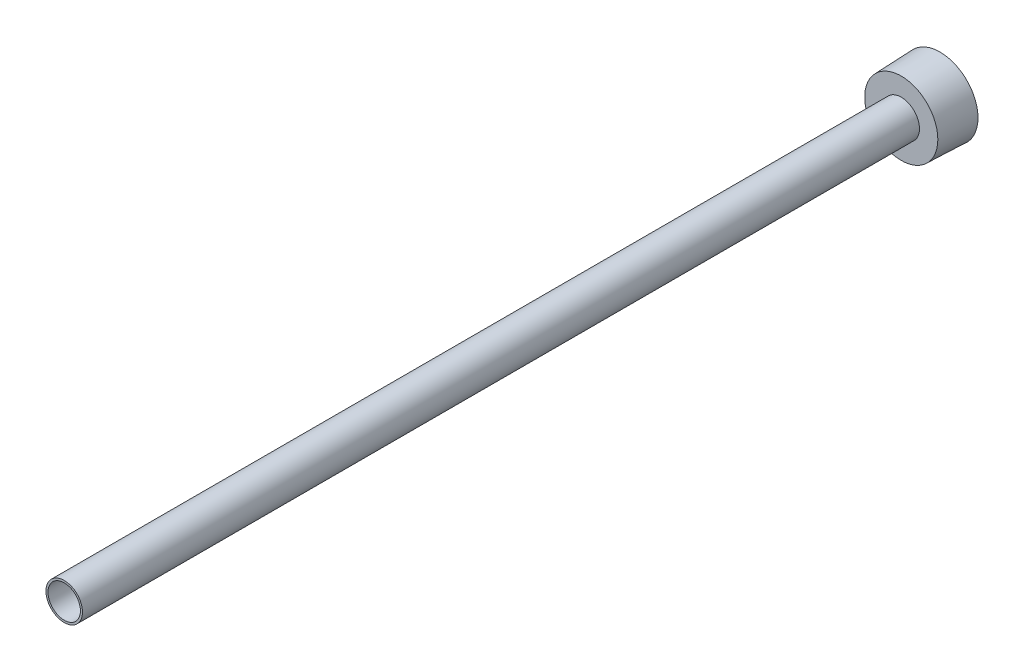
ISO-10303-21;
HEADER;
FILE_DESCRIPTION(('STEP AP214'),'2;1');
FILE_NAME('part.step','',(''),(''),'','','');
FILE_SCHEMA(('AUTOMOTIVE_DESIGN { 1 0 10303 214 1 1 1 1 }'));
ENDSEC;
DATA;
#1=APPLICATION_CONTEXT('core data for automotive mechanical design processes');
#2=APPLICATION_PROTOCOL_DEFINITION('international standard','automotive_design',2000,#1);
#3=PRODUCT_CONTEXT('',#1,'mechanical');
#4=PRODUCT('Part','Part','',(#3));
#5=PRODUCT_RELATED_PRODUCT_CATEGORY('part','',(#4));
#6=PRODUCT_DEFINITION_FORMATION('','',#4);
#7=PRODUCT_DEFINITION_CONTEXT('part definition',#1,'design');
#8=PRODUCT_DEFINITION('design','',#6,#7);
#9=PRODUCT_DEFINITION_SHAPE('','',#8);
#10=(LENGTH_UNIT() NAMED_UNIT(*) SI_UNIT(.MILLI.,.METRE.));
#11=(NAMED_UNIT(*) PLANE_ANGLE_UNIT() SI_UNIT($,.RADIAN.));
#12=(NAMED_UNIT(*) SI_UNIT($,.STERADIAN.) SOLID_ANGLE_UNIT());
#13=UNCERTAINTY_MEASURE_WITH_UNIT(LENGTH_MEASURE(1.E-05),#10,'distance_accuracy_value','');
#14=(GEOMETRIC_REPRESENTATION_CONTEXT(3) GLOBAL_UNCERTAINTY_ASSIGNED_CONTEXT((#13)) GLOBAL_UNIT_ASSIGNED_CONTEXT((#10,
#11,#12)) REPRESENTATION_CONTEXT('',''));
#15=CARTESIAN_POINT('',(0.,0.,0.));
#16=DIRECTION('',(0.,0.,1.));
#17=DIRECTION('',(1.,0.,0.));
#18=AXIS2_PLACEMENT_3D('',#15,#16,#17);
#19=CARTESIAN_POINT('',(0.,0.,0.));
#20=DIRECTION('',(0.,0.,1.));
#21=DIRECTION('',(1.,0.,0.));
#22=AXIS2_PLACEMENT_3D('',#19,#20,#21);
#23=CYLINDRICAL_SURFACE('',#22,5.6388);
#24=CARTESIAN_POINT('',(0.,0.,304.8));
#25=DIRECTION('',(0.,0.,1.));
#26=DIRECTION('',(1.,0.,0.));
#27=AXIS2_PLACEMENT_3D('',#24,#25,#26);
#28=CIRCLE('',#27,5.6388);
#29=CARTESIAN_POINT('',(5.6388,0.,304.8));
#30=VERTEX_POINT('',#29);
#31=EDGE_CURVE('E141',#30,#30,#28,.T.);
#32=ORIENTED_EDGE('',*,*,#31,.T.);
#33=EDGE_LOOP('',(#32));
#34=FACE_BOUND('',#33,.T.);
#35=CARTESIAN_POINT('',(0.,0.,9.525));
#36=DIRECTION('',(0.,0.,-1.));
#37=DIRECTION('',(-1.,0.,0.));
#38=AXIS2_PLACEMENT_3D('',#35,#36,#37);
#39=CIRCLE('',#38,5.6388);
#40=CARTESIAN_POINT('',(-5.6388,0.,9.525));
#41=VERTEX_POINT('',#40);
#42=EDGE_CURVE('E36',#41,#41,#39,.F.);
#43=ORIENTED_EDGE('',*,*,#42,.F.);
#44=EDGE_LOOP('',(#43));
#45=FACE_BOUND('',#44,.T.);
#46=ADVANCED_FACE('F32',(#34,#45),#23,.F.);
#47=CARTESIAN_POINT('',(0.,6.34999999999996,304.8));
#48=DIRECTION('',(0.,0.,-1.));
#49=DIRECTION('',(-1.,0.,0.));
#50=AXIS2_PLACEMENT_3D('',#47,#48,#49);
#51=PLANE('',#50);
#52=ORIENTED_EDGE('',*,*,#31,.F.);
#53=EDGE_LOOP('',(#52));
#54=FACE_BOUND('',#53,.T.);
#55=CARTESIAN_POINT('',(0.,0.,304.8));
#56=DIRECTION('',(0.,0.,1.));
#57=DIRECTION('',(1.,0.,0.));
#58=AXIS2_PLACEMENT_3D('',#55,#56,#57);
#59=CIRCLE('',#58,6.34999999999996);
#60=CARTESIAN_POINT('',(6.34999999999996,0.,304.8));
#61=VERTEX_POINT('',#60);
#62=EDGE_CURVE('E144',#61,#61,#59,.T.);
#63=ORIENTED_EDGE('',*,*,#62,.T.);
#64=EDGE_LOOP('',(#63));
#65=FACE_BOUND('',#64,.T.);
#66=ADVANCED_FACE('F34',(#54,#65),#51,.F.);
#67=CARTESIAN_POINT('',(0.,0.,0.));
#68=DIRECTION('',(0.,0.,1.));
#69=DIRECTION('',(1.,0.,0.));
#70=AXIS2_PLACEMENT_3D('',#67,#68,#69);
#71=PLANE('',#70);
#72=DIRECTION('',(-0.866025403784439,-0.5,0.));
#73=VECTOR('',#72,1.);
#74=CARTESIAN_POINT('',(9.525,-5.49926131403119,0.));
#75=LINE('',#74,#73);
#76=CARTESIAN_POINT('',(9.525,-5.49926131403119,0.));
#77=VERTEX_POINT('',#76);
#78=CARTESIAN_POINT('',(0.,-10.9985226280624,0.));
#79=VERTEX_POINT('',#78);
#80=EDGE_CURVE('E123',#77,#79,#75,.T.);
#81=ORIENTED_EDGE('',*,*,#80,.F.);
#82=DIRECTION('',(0.,-1.,0.));
#83=VECTOR('',#82,1.);
#84=CARTESIAN_POINT('',(9.525,5.49926131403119,0.));
#85=LINE('',#84,#83);
#86=CARTESIAN_POINT('',(9.525,5.49926131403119,0.));
#87=VERTEX_POINT('',#86);
#88=EDGE_CURVE('E48',#87,#77,#85,.T.);
#89=ORIENTED_EDGE('',*,*,#88,.F.);
#90=DIRECTION('',(0.866025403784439,-0.5,0.));
#91=VECTOR('',#90,1.);
#92=CARTESIAN_POINT('',(0.,10.9985226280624,0.));
#93=LINE('',#92,#91);
#94=CARTESIAN_POINT('',(0.,10.9985226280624,0.));
#95=VERTEX_POINT('',#94);
#96=EDGE_CURVE('E132',#95,#87,#93,.T.);
#97=ORIENTED_EDGE('',*,*,#96,.F.);
#98=DIRECTION('',(0.866025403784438,0.5,0.));
#99=VECTOR('',#98,1.);
#100=CARTESIAN_POINT('',(-9.525,5.49926131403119,0.));
#101=LINE('',#100,#99);
#102=CARTESIAN_POINT('',(-9.525,5.49926131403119,0.));
#103=VERTEX_POINT('',#102);
#104=EDGE_CURVE('E130',#103,#95,#101,.T.);
#105=ORIENTED_EDGE('',*,*,#104,.F.);
#106=DIRECTION('',(0.,1.,0.));
#107=VECTOR('',#106,1.);
#108=CARTESIAN_POINT('',(-9.525,-5.49926131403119,0.));
#109=LINE('',#108,#107);
#110=CARTESIAN_POINT('',(-9.525,-5.49926131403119,0.));
#111=VERTEX_POINT('',#110);
#112=EDGE_CURVE('E96',#111,#103,#109,.T.);
#113=ORIENTED_EDGE('',*,*,#112,.F.);
#114=DIRECTION('',(-0.866025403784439,0.5,0.));
#115=VECTOR('',#114,1.);
#116=CARTESIAN_POINT('',(0.,-10.9985226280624,0.));
#117=LINE('',#116,#115);
#118=EDGE_CURVE('E126',#79,#111,#117,.T.);
#119=ORIENTED_EDGE('',*,*,#118,.F.);
#120=EDGE_LOOP('',(#81,#89,#97,#105,#113,#119));
#121=FACE_BOUND('',#120,.T.);
#122=CARTESIAN_POINT('',(0.,0.,0.));
#123=DIRECTION('',(0.,0.,1.));
#124=DIRECTION('',(1.,0.,0.));
#125=AXIS2_PLACEMENT_3D('',#122,#123,#124);
#126=CIRCLE('',#125,13.2207);
#127=CARTESIAN_POINT('',(13.2207,0.,0.));
#128=VERTEX_POINT('',#127);
#129=EDGE_CURVE('E11',#128,#128,#126,.T.);
#130=ORIENTED_EDGE('',*,*,#129,.F.);
#131=EDGE_LOOP('',(#130));
#132=FACE_BOUND('',#131,.T.);
#133=ADVANCED_FACE('F158',(#121,#132),#71,.F.);
#134=CARTESIAN_POINT('',(0.,0.,0.));
#135=DIRECTION('',(0.,0.,-1.));
#136=DIRECTION('',(-1.,0.,0.));
#137=AXIS2_PLACEMENT_3D('',#134,#135,#136);
#138=CONICAL_SURFACE('',#137,13.2207,0.0364599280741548);
#139=CARTESIAN_POINT('',(0.,0.,13.4874));
#140=DIRECTION('',(0.,0.,1.));
#141=DIRECTION('',(1.,0.,0.));
#142=AXIS2_PLACEMENT_3D('',#139,#140,#141);
#143=CIRCLE('',#142,12.7287323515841);
#144=CARTESIAN_POINT('',(12.7287323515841,0.,13.4874));
#145=VERTEX_POINT('',#144);
#146=EDGE_CURVE('E41',#145,#145,#143,.T.);
#147=ORIENTED_EDGE('',*,*,#146,.F.);
#148=EDGE_LOOP('',(#147));
#149=FACE_BOUND('',#148,.T.);
#150=ORIENTED_EDGE('',*,*,#129,.T.);
#151=EDGE_LOOP('',(#150));
#152=FACE_BOUND('',#151,.T.);
#153=ADVANCED_FACE('F155',(#149,#152),#138,.T.);
#154=CARTESIAN_POINT('',(0.,12.7287323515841,13.4874));
#155=DIRECTION('',(0.,0.,-1.));
#156=DIRECTION('',(-1.,0.,0.));
#157=AXIS2_PLACEMENT_3D('',#154,#155,#156);
#158=PLANE('',#157);
#159=CARTESIAN_POINT('',(0.,0.,13.4874));
#160=DIRECTION('',(0.,0.,1.));
#161=DIRECTION('',(1.,0.,0.));
#162=AXIS2_PLACEMENT_3D('',#159,#160,#161);
#163=CIRCLE('',#162,6.35);
#164=CARTESIAN_POINT('',(6.35,0.,13.4874));
#165=VERTEX_POINT('',#164);
#166=EDGE_CURVE('E147',#165,#165,#163,.T.);
#167=ORIENTED_EDGE('',*,*,#166,.F.);
#168=EDGE_LOOP('',(#167));
#169=FACE_BOUND('',#168,.T.);
#170=ORIENTED_EDGE('',*,*,#146,.T.);
#171=EDGE_LOOP('',(#170));
#172=FACE_BOUND('',#171,.T.);
#173=ADVANCED_FACE('F153',(#169,#172),#158,.F.);
#174=CARTESIAN_POINT('',(0.,0.,278.00111462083));
#175=DIRECTION('',(0.,0.,1.));
#176=DIRECTION('',(1.,0.,0.));
#177=AXIS2_PLACEMENT_3D('',#174,#175,#176);
#178=CYLINDRICAL_SURFACE('',#177,6.34999999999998);
#179=ORIENTED_EDGE('',*,*,#62,.F.);
#180=EDGE_LOOP('',(#179));
#181=FACE_BOUND('',#180,.T.);
#182=ORIENTED_EDGE('',*,*,#166,.T.);
#183=EDGE_LOOP('',(#182));
#184=FACE_BOUND('',#183,.T.);
#185=ADVANCED_FACE('F179',(#181,#184),#178,.T.);
#186=CARTESIAN_POINT('',(9.525,-5.49926131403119,9.525));
#187=DIRECTION('',(0.,0.,-1.));
#188=DIRECTION('',(-1.,0.,0.));
#189=AXIS2_PLACEMENT_3D('',#186,#187,#188);
#190=PLANE('',#189);
#191=DIRECTION('',(0.,-1.,0.));
#192=VECTOR('',#191,1.);
#193=CARTESIAN_POINT('',(9.525,5.49926131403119,9.525));
#194=LINE('',#193,#192);
#195=CARTESIAN_POINT('',(9.525,5.49926131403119,9.525));
#196=VERTEX_POINT('',#195);
#197=CARTESIAN_POINT('',(9.525,-5.49926131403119,9.525));
#198=VERTEX_POINT('',#197);
#199=EDGE_CURVE('E134',#196,#198,#194,.T.);
#200=ORIENTED_EDGE('',*,*,#199,.T.);
#201=DIRECTION('',(-0.866025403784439,-0.5,0.));
#202=VECTOR('',#201,1.);
#203=CARTESIAN_POINT('',(9.525,-5.49926131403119,9.525));
#204=LINE('',#203,#202);
#205=CARTESIAN_POINT('',(0.,-10.9985226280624,9.525));
#206=VERTEX_POINT('',#205);
#207=EDGE_CURVE('E117',#198,#206,#204,.T.);
#208=ORIENTED_EDGE('',*,*,#207,.T.);
#209=DIRECTION('',(-0.866025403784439,0.5,0.));
#210=VECTOR('',#209,1.);
#211=CARTESIAN_POINT('',(0.,-10.9985226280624,9.525));
#212=LINE('',#211,#210);
#213=CARTESIAN_POINT('',(-9.525,-5.49926131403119,9.525));
#214=VERTEX_POINT('',#213);
#215=EDGE_CURVE('E115',#206,#214,#212,.T.);
#216=ORIENTED_EDGE('',*,*,#215,.T.);
#217=DIRECTION('',(0.,1.,0.));
#218=VECTOR('',#217,1.);
#219=CARTESIAN_POINT('',(-9.525,-5.49926131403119,9.525));
#220=LINE('',#219,#218);
#221=CARTESIAN_POINT('',(-9.525,5.49926131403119,9.525));
#222=VERTEX_POINT('',#221);
#223=EDGE_CURVE('E93',#214,#222,#220,.T.);
#224=ORIENTED_EDGE('',*,*,#223,.T.);
#225=DIRECTION('',(0.866025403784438,0.5,0.));
#226=VECTOR('',#225,1.);
#227=CARTESIAN_POINT('',(-9.525,5.49926131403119,9.525));
#228=LINE('',#227,#226);
#229=CARTESIAN_POINT('',(0.,10.9985226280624,9.525));
#230=VERTEX_POINT('',#229);
#231=EDGE_CURVE('E104',#222,#230,#228,.T.);
#232=ORIENTED_EDGE('',*,*,#231,.T.);
#233=DIRECTION('',(0.866025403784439,-0.5,0.));
#234=VECTOR('',#233,1.);
#235=CARTESIAN_POINT('',(0.,10.9985226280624,9.525));
#236=LINE('',#235,#234);
#237=EDGE_CURVE('E108',#230,#196,#236,.T.);
#238=ORIENTED_EDGE('',*,*,#237,.T.);
#239=EDGE_LOOP('',(#200,#208,#216,#224,#232,#238));
#240=FACE_BOUND('',#239,.T.);
#241=ORIENTED_EDGE('',*,*,#42,.T.);
#242=EDGE_LOOP('',(#241));
#243=FACE_BOUND('',#242,.T.);
#244=ADVANCED_FACE('F111',(#240,#243),#190,.T.);
#245=CARTESIAN_POINT('',(9.525,5.49926131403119,9.525));
#246=DIRECTION('',(1.,0.,0.));
#247=DIRECTION('',(0.,1.,0.));
#248=AXIS2_PLACEMENT_3D('',#245,#246,#247);
#249=PLANE('',#248);
#250=ORIENTED_EDGE('',*,*,#88,.T.);
#251=DIRECTION('',(0.,0.,-1.));
#252=VECTOR('',#251,1.);
#253=CARTESIAN_POINT('',(9.525,-5.49926131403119,9.525));
#254=LINE('',#253,#252);
#255=EDGE_CURVE('E78',#198,#77,#254,.T.);
#256=ORIENTED_EDGE('',*,*,#255,.F.);
#257=ORIENTED_EDGE('',*,*,#199,.F.);
#258=DIRECTION('',(0.,0.,-1.));
#259=VECTOR('',#258,1.);
#260=CARTESIAN_POINT('',(9.525,5.49926131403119,9.525));
#261=LINE('',#260,#259);
#262=EDGE_CURVE('E56',#196,#87,#261,.T.);
#263=ORIENTED_EDGE('',*,*,#262,.T.);
#264=EDGE_LOOP('',(#250,#256,#257,#263));
#265=FACE_BOUND('',#264,.T.);
#266=ADVANCED_FACE('F177',(#265),#249,.F.);
#267=CARTESIAN_POINT('',(0.,10.9985226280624,9.525));
#268=DIRECTION('',(0.5,0.866025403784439,0.));
#269=DIRECTION('',(-0.866025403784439,0.5,0.));
#270=AXIS2_PLACEMENT_3D('',#267,#268,#269);
#271=PLANE('',#270);
#272=ORIENTED_EDGE('',*,*,#96,.T.);
#273=ORIENTED_EDGE('',*,*,#262,.F.);
#274=ORIENTED_EDGE('',*,*,#237,.F.);
#275=DIRECTION('',(0.,0.,-1.));
#276=VECTOR('',#275,1.);
#277=CARTESIAN_POINT('',(0.,10.9985226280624,9.525));
#278=LINE('',#277,#276);
#279=EDGE_CURVE('E100',#230,#95,#278,.T.);
#280=ORIENTED_EDGE('',*,*,#279,.T.);
#281=EDGE_LOOP('',(#272,#273,#274,#280));
#282=FACE_BOUND('',#281,.T.);
#283=ADVANCED_FACE('F208',(#282),#271,.F.);
#284=CARTESIAN_POINT('',(-9.525,5.49926131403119,9.525));
#285=DIRECTION('',(-0.5,0.866025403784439,0.));
#286=DIRECTION('',(-0.866025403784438,-0.5,0.));
#287=AXIS2_PLACEMENT_3D('',#284,#285,#286);
#288=PLANE('',#287);
#289=ORIENTED_EDGE('',*,*,#104,.T.);
#290=ORIENTED_EDGE('',*,*,#279,.F.);
#291=ORIENTED_EDGE('',*,*,#231,.F.);
#292=DIRECTION('',(0.,0.,-1.));
#293=VECTOR('',#292,1.);
#294=CARTESIAN_POINT('',(-9.525,5.49926131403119,9.525));
#295=LINE('',#294,#293);
#296=EDGE_CURVE('E89',#222,#103,#295,.T.);
#297=ORIENTED_EDGE('',*,*,#296,.T.);
#298=EDGE_LOOP('',(#289,#290,#291,#297));
#299=FACE_BOUND('',#298,.T.);
#300=ADVANCED_FACE('F105',(#299),#288,.F.);
#301=CARTESIAN_POINT('',(-9.525,-5.49926131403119,9.525));
#302=DIRECTION('',(-1.,0.,0.));
#303=DIRECTION('',(0.,-1.,0.));
#304=AXIS2_PLACEMENT_3D('',#301,#302,#303);
#305=PLANE('',#304);
#306=ORIENTED_EDGE('',*,*,#112,.T.);
#307=ORIENTED_EDGE('',*,*,#296,.F.);
#308=ORIENTED_EDGE('',*,*,#223,.F.);
#309=DIRECTION('',(0.,0.,-1.));
#310=VECTOR('',#309,1.);
#311=CARTESIAN_POINT('',(-9.525,-5.49926131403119,9.525));
#312=LINE('',#311,#310);
#313=EDGE_CURVE('E101',#214,#111,#312,.T.);
#314=ORIENTED_EDGE('',*,*,#313,.T.);
#315=EDGE_LOOP('',(#306,#307,#308,#314));
#316=FACE_BOUND('',#315,.T.);
#317=ADVANCED_FACE('F91',(#316),#305,.F.);
#318=CARTESIAN_POINT('',(0.,-10.9985226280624,9.525));
#319=DIRECTION('',(-0.5,-0.866025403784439,0.));
#320=DIRECTION('',(0.866025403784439,-0.5,0.));
#321=AXIS2_PLACEMENT_3D('',#318,#319,#320);
#322=PLANE('',#321);
#323=ORIENTED_EDGE('',*,*,#118,.T.);
#324=ORIENTED_EDGE('',*,*,#313,.F.);
#325=ORIENTED_EDGE('',*,*,#215,.F.);
#326=DIRECTION('',(0.,0.,-1.));
#327=VECTOR('',#326,1.);
#328=CARTESIAN_POINT('',(0.,-10.9985226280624,9.525));
#329=LINE('',#328,#327);
#330=EDGE_CURVE('E138',#206,#79,#329,.T.);
#331=ORIENTED_EDGE('',*,*,#330,.T.);
#332=EDGE_LOOP('',(#323,#324,#325,#331));
#333=FACE_BOUND('',#332,.T.);
#334=ADVANCED_FACE('F226',(#333),#322,.F.);
#335=CARTESIAN_POINT('',(9.525,-5.49926131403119,9.525));
#336=DIRECTION('',(0.5,-0.866025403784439,0.));
#337=DIRECTION('',(0.866025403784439,0.5,0.));
#338=AXIS2_PLACEMENT_3D('',#335,#336,#337);
#339=PLANE('',#338);
#340=ORIENTED_EDGE('',*,*,#80,.T.);
#341=ORIENTED_EDGE('',*,*,#330,.F.);
#342=ORIENTED_EDGE('',*,*,#207,.F.);
#343=ORIENTED_EDGE('',*,*,#255,.T.);
#344=EDGE_LOOP('',(#340,#341,#342,#343));
#345=FACE_BOUND('',#344,.T.);
#346=ADVANCED_FACE('F233',(#345),#339,.F.);
#347=CLOSED_SHELL('',(#46,#66,#133,#153,#173,#185,#244,#266,#283,#300,#317,#334,#346));
#348=MANIFOLD_SOLID_BREP('B2',#347);
#349=ADVANCED_BREP_SHAPE_REPRESENTATION('',(#18,#348),#14);
#350=SHAPE_DEFINITION_REPRESENTATION(#9,#349);
ENDSEC;
END-ISO-10303-21;
